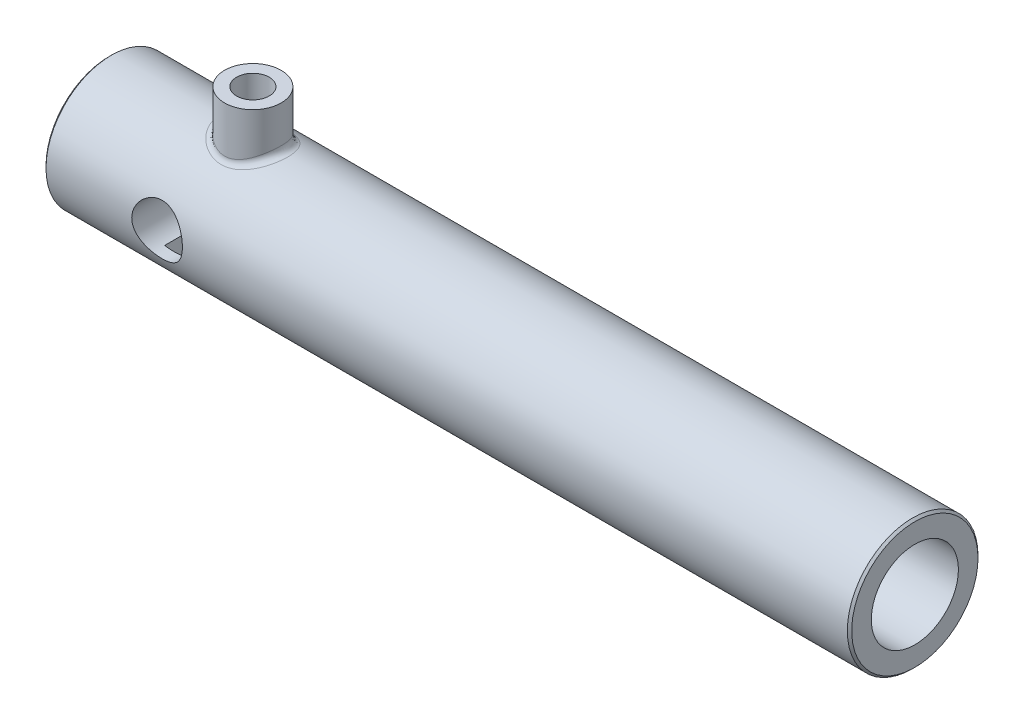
from build123d import *

# Parameters (mm, degrees)
ESQUISSE1_W                     = 370
ESQUISSE1_H                     = 30
ESQUISSE2_W                     = 13
ESQUISSE2_H                     = 22.962988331
DIAM_TRE_DU_PER_AGE_6_8_6_8_1_D = 6.8
CHANFREIN1_SIZE                 = 1
CONG_1_R                        = 2.999965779
ESQUISSE10_W                    = 60
ESQUISSE10_H                    = 11.625
ENL_V_MAT_EXTRU_1_REACH         = 333.21
ENL_V_MAT_EXTRU_1_END_RADIUS    = 25
ESQUISSE11_R                    = 7.5


with BuildPart() as part:
    # Esquisse1 → R_volution1 (revolve)
    with BuildSketch(Plane(origin=(0, 0, 0), x_dir=(-1, 0, 0), z_dir=(0, 0, -1)), mode=Mode.PRIVATE) as r_volution1_sk:
        with Locations((-135, 15)):
            Rectangle(ESQUISSE1_W, ESQUISSE1_H)
    revolve(r_volution1_sk.sketch.rotate(Axis((320, 0, 0), (-1, 0, 0)), 270), axis=Axis((320, 0, 0), (-1, 0, 0)))

    # Esquisse2 → R_volution2 (revolve)
    with BuildSketch(Plane(origin=(16, 0, 0), x_dir=(0, 0, -1), z_dir=(1, 0, 0))):
        with Locations((6.5, 38.518505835)):
            Rectangle(ESQUISSE2_W, ESQUISSE2_H)
    revolve(axis=Axis((16, 50, 0), (0, -1, 0)))

    # Diam_tre du per_age _6.8 _6.8_1 (through all)
    with Locations(Plane.ZY.offset(50)):
        with Locations((0, 0)):
            Hole(DIAM_TRE_DU_PER_AGE_6_8_6_8_1_D / 2)

    # Esquisse6 → Chambrage pour vis _ t_te hexagonale M48 (revolve, cut)
    with BuildSketch(Plane(origin=(320, 0, 0), x_dir=(0, 0, -1), z_dir=(0, 1, 0))):
        Polygon((0, 0), (0, 322), (25, 322), (25, 59), (20, 59), (20, 0), align=None)
    revolve(axis=Axis((326.35, 0, 0), (-1, 0, 0)), mode=Mode.SUBTRACT)

    # Chanfrein1
    chanfrein1_edges = [part.edges().sort_by_distance(p)[0] for p in [
        (-50, 0, -30),
        (320, 0, -30),
    ]]
    chamfer(chanfrein1_edges, length=CHANFREIN1_SIZE)

    # Cong_1
    cong_1_edges = [part.edges().sort_by_distance(p)[0] for p in [
        (16, 27.037011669, 13),
    ]]
    fillet(cong_1_edges, radius=CONG_1_R)

    # Esquisse10 → Enl_vement de mati_re-R_volution3 (revolve, cut)
    with BuildSketch(Plane(origin=(2, 0, 0), x_dir=(0, 0, -1), z_dir=(1, 0, 0)), mode=Mode.PRIVATE) as enl_vement_de_mati_re_r_volution3_sk:
        with Locations((0, 5.8125)):
            Rectangle(ESQUISSE10_W, ESQUISSE10_H)
    revolve(enl_vement_de_mati_re_r_volution3_sk.sketch.rotate(Axis((2, 0, 36.375745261), (0, 0, -1)), 90), axis=Axis((2, 0, 36.375745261), (0, 0, -1)), mode=Mode.SUBTRACT)

    # Enl_v. mat.-Extru.1: up to this cylinder (the profile starts outside it)
    enl_v_mat_extru_1_end = Plane(origin=(16, 0, 0), z_dir=(1, 0, 0)) * Cylinder(ENL_V_MAT_EXTRU_1_END_RADIUS, 717.42, mode=Mode.PRIVATE)
    # Esquisse11 → Enl_v. mat.-Extru.1 (cut, up to the surface)
    with BuildSketch(Plane(origin=(0, 50, 0), x_dir=(1, 0, 0), z_dir=(0, 1, 0)), mode=Mode.PRIVATE) as enl_v_mat_extru_1_sk1:
        with Locations(Location((16, 0, 0), (0, 0, 270))):
            Circle(ESQUISSE11_R)
    enl_v_mat_extru_1_tool1 = extrude(enl_v_mat_extru_1_sk1.sketch, amount=-ENL_V_MAT_EXTRU_1_REACH, mode=Mode.PRIVATE) - enl_v_mat_extru_1_end
    add(enl_v_mat_extru_1_tool1.solids().sort_by_distance((16, 50, 0))[0], mode=Mode.SUBTRACT)


solid = part.part
